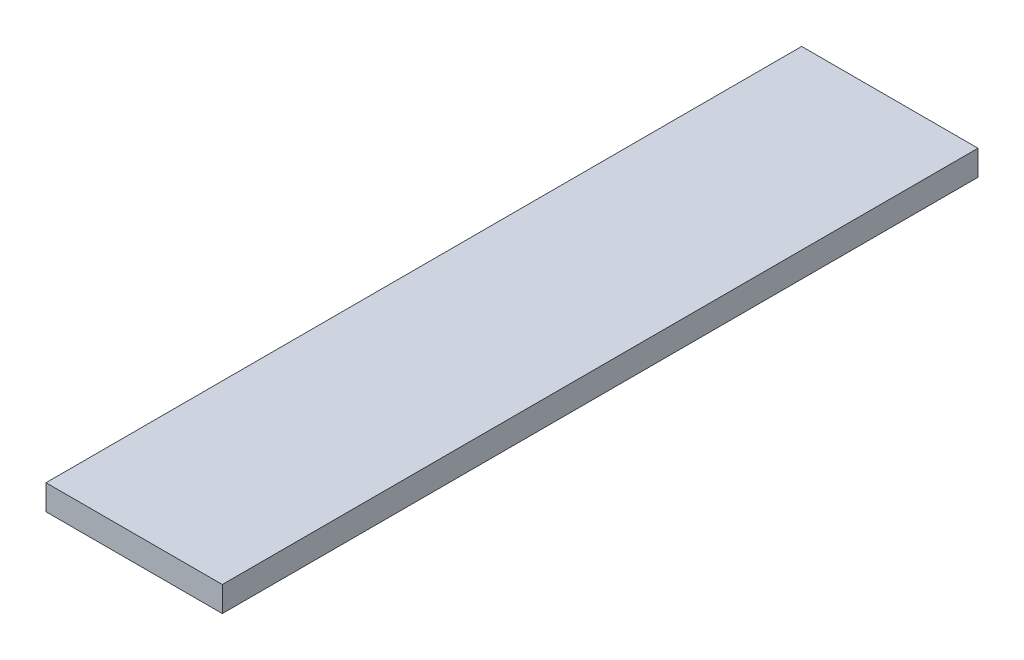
ISO-10303-21;
HEADER;
FILE_DESCRIPTION(('STEP AP214'),'2;1');
FILE_NAME('part.step','',(''),(''),'','','');
FILE_SCHEMA(('AUTOMOTIVE_DESIGN { 1 0 10303 214 1 1 1 1 }'));
ENDSEC;
DATA;
#1=APPLICATION_CONTEXT('core data for automotive mechanical design processes');
#2=APPLICATION_PROTOCOL_DEFINITION('international standard','automotive_design',2000,#1);
#3=PRODUCT_CONTEXT('',#1,'mechanical');
#4=PRODUCT('Part','Part','',(#3));
#5=PRODUCT_RELATED_PRODUCT_CATEGORY('part','',(#4));
#6=PRODUCT_DEFINITION_FORMATION('','',#4);
#7=PRODUCT_DEFINITION_CONTEXT('part definition',#1,'design');
#8=PRODUCT_DEFINITION('design','',#6,#7);
#9=PRODUCT_DEFINITION_SHAPE('','',#8);
#10=(LENGTH_UNIT() NAMED_UNIT(*) SI_UNIT(.MILLI.,.METRE.));
#11=(NAMED_UNIT(*) PLANE_ANGLE_UNIT() SI_UNIT($,.RADIAN.));
#12=(NAMED_UNIT(*) SI_UNIT($,.STERADIAN.) SOLID_ANGLE_UNIT());
#13=UNCERTAINTY_MEASURE_WITH_UNIT(LENGTH_MEASURE(1.E-05),#10,'distance_accuracy_value','');
#14=(GEOMETRIC_REPRESENTATION_CONTEXT(3) GLOBAL_UNCERTAINTY_ASSIGNED_CONTEXT((#13)) GLOBAL_UNIT_ASSIGNED_CONTEXT((#10,
#11,#12)) REPRESENTATION_CONTEXT('',''));
#15=CARTESIAN_POINT('',(0.,0.,0.));
#16=DIRECTION('',(0.,0.,1.));
#17=DIRECTION('',(1.,0.,0.));
#18=AXIS2_PLACEMENT_3D('',#15,#16,#17);
#19=CARTESIAN_POINT('',(3.5,0.5,15.));
#20=DIRECTION('',(-1.,0.,0.));
#21=DIRECTION('',(0.,0.,1.));
#22=AXIS2_PLACEMENT_3D('',#19,#20,#21);
#23=PLANE('',#22);
#24=DIRECTION('',(0.,0.,-1.));
#25=VECTOR('',#24,1.);
#26=CARTESIAN_POINT('',(3.5,-0.5,15.));
#27=LINE('',#26,#25);
#28=CARTESIAN_POINT('',(3.5,-0.5,15.));
#29=VERTEX_POINT('',#28);
#30=CARTESIAN_POINT('',(3.5,-0.5,-15.));
#31=VERTEX_POINT('',#30);
#32=EDGE_CURVE('E107',#29,#31,#27,.T.);
#33=ORIENTED_EDGE('',*,*,#32,.T.);
#34=DIRECTION('',(0.,-1.,0.));
#35=VECTOR('',#34,1.);
#36=CARTESIAN_POINT('',(3.5,0.5,-15.));
#37=LINE('',#36,#35);
#38=CARTESIAN_POINT('',(3.5,0.5,-15.));
#39=VERTEX_POINT('',#38);
#40=EDGE_CURVE('E11',#39,#31,#37,.T.);
#41=ORIENTED_EDGE('',*,*,#40,.F.);
#42=DIRECTION('',(0.,0.,-1.));
#43=VECTOR('',#42,1.);
#44=CARTESIAN_POINT('',(3.5,0.5,15.));
#45=LINE('',#44,#43);
#46=CARTESIAN_POINT('',(3.5,0.5,15.));
#47=VERTEX_POINT('',#46);
#48=EDGE_CURVE('E91',#47,#39,#45,.T.);
#49=ORIENTED_EDGE('',*,*,#48,.F.);
#50=DIRECTION('',(0.,-1.,0.));
#51=VECTOR('',#50,1.);
#52=CARTESIAN_POINT('',(3.5,0.5,15.));
#53=LINE('',#52,#51);
#54=EDGE_CURVE('E103',#47,#29,#53,.T.);
#55=ORIENTED_EDGE('',*,*,#54,.T.);
#56=EDGE_LOOP('',(#33,#41,#49,#55));
#57=FACE_BOUND('',#56,.T.);
#58=ADVANCED_FACE('F39',(#57),#23,.F.);
#59=CARTESIAN_POINT('',(-3.5,0.5,-15.));
#60=DIRECTION('',(0.,0.,1.));
#61=DIRECTION('',(1.,0.,0.));
#62=AXIS2_PLACEMENT_3D('',#59,#60,#61);
#63=PLANE('',#62);
#64=DIRECTION('',(-1.,0.,0.));
#65=VECTOR('',#64,1.);
#66=CARTESIAN_POINT('',(-3.5,-0.5,-15.));
#67=LINE('',#66,#65);
#68=CARTESIAN_POINT('',(-3.5,-0.5,-15.));
#69=VERTEX_POINT('',#68);
#70=EDGE_CURVE('E96',#31,#69,#67,.T.);
#71=ORIENTED_EDGE('',*,*,#70,.T.);
#72=DIRECTION('',(0.,-1.,0.));
#73=VECTOR('',#72,1.);
#74=CARTESIAN_POINT('',(-3.5,0.5,-15.));
#75=LINE('',#74,#73);
#76=CARTESIAN_POINT('',(-3.5,0.5,-15.));
#77=VERTEX_POINT('',#76);
#78=EDGE_CURVE('E48',#77,#69,#75,.T.);
#79=ORIENTED_EDGE('',*,*,#78,.F.);
#80=DIRECTION('',(-1.,0.,0.));
#81=VECTOR('',#80,1.);
#82=CARTESIAN_POINT('',(-3.5,0.5,-15.));
#83=LINE('',#82,#81);
#84=EDGE_CURVE('E86',#39,#77,#83,.T.);
#85=ORIENTED_EDGE('',*,*,#84,.F.);
#86=ORIENTED_EDGE('',*,*,#40,.T.);
#87=EDGE_LOOP('',(#71,#79,#85,#86));
#88=FACE_BOUND('',#87,.T.);
#89=ADVANCED_FACE('F95',(#88),#63,.F.);
#90=CARTESIAN_POINT('',(-3.5,0.5,15.));
#91=DIRECTION('',(1.,0.,0.));
#92=DIRECTION('',(0.,0.,-1.));
#93=AXIS2_PLACEMENT_3D('',#90,#91,#92);
#94=PLANE('',#93);
#95=DIRECTION('',(0.,0.,1.));
#96=VECTOR('',#95,1.);
#97=CARTESIAN_POINT('',(-3.5,-0.5,15.));
#98=LINE('',#97,#96);
#99=CARTESIAN_POINT('',(-3.5,-0.5,15.));
#100=VERTEX_POINT('',#99);
#101=EDGE_CURVE('E73',#69,#100,#98,.T.);
#102=ORIENTED_EDGE('',*,*,#101,.T.);
#103=DIRECTION('',(0.,-1.,0.));
#104=VECTOR('',#103,1.);
#105=CARTESIAN_POINT('',(-3.5,0.5,15.));
#106=LINE('',#105,#104);
#107=CARTESIAN_POINT('',(-3.5,0.5,15.));
#108=VERTEX_POINT('',#107);
#109=EDGE_CURVE('E98',#108,#100,#106,.T.);
#110=ORIENTED_EDGE('',*,*,#109,.F.);
#111=DIRECTION('',(0.,0.,1.));
#112=VECTOR('',#111,1.);
#113=CARTESIAN_POINT('',(-3.5,0.5,15.));
#114=LINE('',#113,#112);
#115=EDGE_CURVE('E89',#77,#108,#114,.T.);
#116=ORIENTED_EDGE('',*,*,#115,.F.);
#117=ORIENTED_EDGE('',*,*,#78,.T.);
#118=EDGE_LOOP('',(#102,#110,#116,#117));
#119=FACE_BOUND('',#118,.T.);
#120=ADVANCED_FACE('F99',(#119),#94,.F.);
#121=CARTESIAN_POINT('',(-3.5,0.5,15.));
#122=DIRECTION('',(0.,0.,-1.));
#123=DIRECTION('',(-1.,0.,0.));
#124=AXIS2_PLACEMENT_3D('',#121,#122,#123);
#125=PLANE('',#124);
#126=DIRECTION('',(1.,0.,0.));
#127=VECTOR('',#126,1.);
#128=CARTESIAN_POINT('',(-3.5,-0.5,15.));
#129=LINE('',#128,#127);
#130=EDGE_CURVE('E79',#100,#29,#129,.T.);
#131=ORIENTED_EDGE('',*,*,#130,.T.);
#132=ORIENTED_EDGE('',*,*,#54,.F.);
#133=DIRECTION('',(1.,0.,0.));
#134=VECTOR('',#133,1.);
#135=CARTESIAN_POINT('',(-3.5,0.5,15.));
#136=LINE('',#135,#134);
#137=EDGE_CURVE('E56',#108,#47,#136,.T.);
#138=ORIENTED_EDGE('',*,*,#137,.F.);
#139=ORIENTED_EDGE('',*,*,#109,.T.);
#140=EDGE_LOOP('',(#131,#132,#138,#139));
#141=FACE_BOUND('',#140,.T.);
#142=ADVANCED_FACE('F120',(#141),#125,.F.);
#143=CARTESIAN_POINT('',(0.,0.5,0.));
#144=DIRECTION('',(0.,-1.,0.));
#145=DIRECTION('',(0.,0.,-1.));
#146=AXIS2_PLACEMENT_3D('',#143,#144,#145);
#147=PLANE('',#146);
#148=ORIENTED_EDGE('',*,*,#48,.T.);
#149=ORIENTED_EDGE('',*,*,#84,.T.);
#150=ORIENTED_EDGE('',*,*,#115,.T.);
#151=ORIENTED_EDGE('',*,*,#137,.T.);
#152=EDGE_LOOP('',(#148,#149,#150,#151));
#153=FACE_BOUND('',#152,.T.);
#154=ADVANCED_FACE('F87',(#153),#147,.F.);
#155=CARTESIAN_POINT('',(0.,-0.5,0.));
#156=DIRECTION('',(0.,-1.,0.));
#157=DIRECTION('',(0.,0.,-1.));
#158=AXIS2_PLACEMENT_3D('',#155,#156,#157);
#159=PLANE('',#158);
#160=ORIENTED_EDGE('',*,*,#32,.F.);
#161=ORIENTED_EDGE('',*,*,#130,.F.);
#162=ORIENTED_EDGE('',*,*,#101,.F.);
#163=ORIENTED_EDGE('',*,*,#70,.F.);
#164=EDGE_LOOP('',(#160,#161,#162,#163));
#165=FACE_BOUND('',#164,.T.);
#166=ADVANCED_FACE('F123',(#165),#159,.T.);
#167=CLOSED_SHELL('',(#58,#89,#120,#142,#154,#166));
#168=MANIFOLD_SOLID_BREP('B2',#167);
#169=ADVANCED_BREP_SHAPE_REPRESENTATION('',(#18,#168),#14);
#170=SHAPE_DEFINITION_REPRESENTATION(#9,#169);
ENDSEC;
END-ISO-10303-21;
